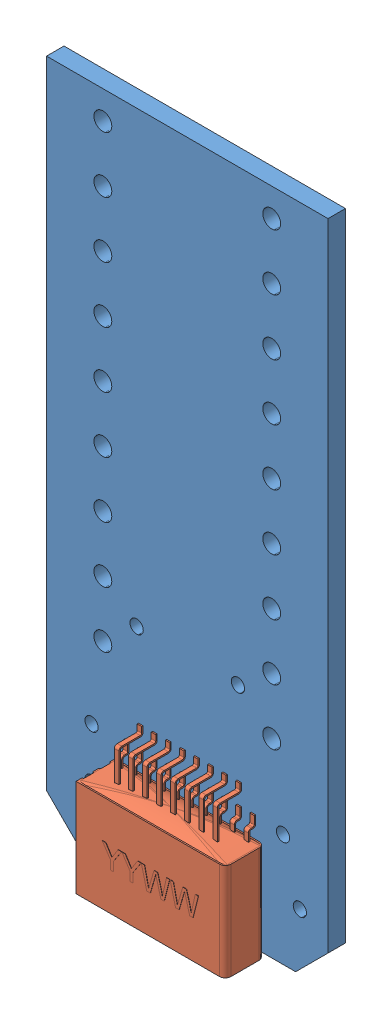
SolidWorks assembly Electrode_Adapter_18pin.SLDASM, configuration Default (file format 15000). Lengths in mm.
Overall size (12.7 30.29 2.58).
2 component instances, 2 part files, 4 mates.
Components (placement in the parent):
- Electrode_Adapter_18pin_PCB-1: Electrode_Adapter_18pin_PCB.SLDPRT [Default] at origin size (12.7 30.16 0.79)
- A79040-001-1: A79040-001.SLDPRT [Default] at (6.477 2.0701 1.6764) x (1 0 0) z (0 -1 0) size (6.73 1.8 6.3)
Mates (geometry in assembly coordinates):
- Coincident1: coincident anti-aligned: plane of Electrode_Adapter_18pin-1 through (0 0 0.7874) normal (0 0 1); plane of A79040-001-1 through (-5.7785 4.2672 0.7874) normal (0 0 -1)
- Parallel1: parallel aligned: plane of Electrode_Adapter_18pin-1 through (11.2395 0 0.7874) normal (0 -1 0); plane of A79040-001-1 through (-5.7785 -0.127 2.5654) normal (0 -1 0)
- Distance1: distance = 0.127 mm: line of A79040-001-1 through (3.1115 -0.127 0.7874) axis (1 0 0); line of Electrode_Adapter_18pin-1 through (1.4605 0 0.7874) axis (1 0 0)
- Distance2: distance = 3.1115 mm: line of A79040-001-1 through (3.1115 4.2672 0.7874) axis (0 -1 0); line of Electrode_Adapter_18pin-1 through (0 30.1625 0.7874) axis (0 -1 0)
